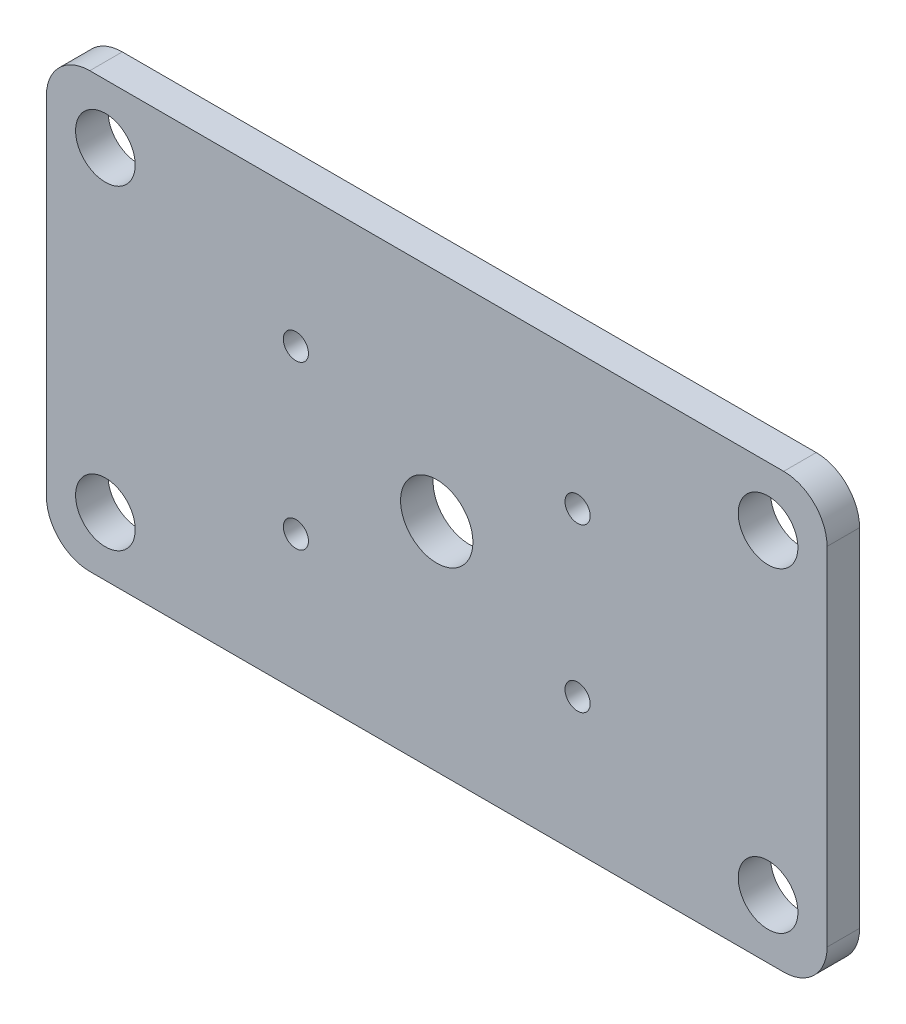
from build123d import *

# Parameters (mm, degrees)
SKETCH1_R           = 1.8415
SKETCH1_R_2         = 4.3688
SKETCH1_R_3         = 5.2959
BOSS_EXTRUDE1_DEPTH = 4.7625


with BuildPart() as part:
    # Sketch1 → Boss-Extrude1 (new body)
    with BuildSketch(Plane.XY.offset(4.7625)):
        with BuildLine():
            Line((57.15, -25.4), (57.15, 25.4))
            ThreePointArc((57.15, 25.4), (55.290128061, 29.890128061), (50.8, 31.75))
            Line((50.8, 31.75), (-50.8, 31.75))
            ThreePointArc((-50.8, 31.75), (-55.290128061, 29.890128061), (-57.15, 25.4))
            Line((-57.15, 25.4), (-57.15, -25.4))
            ThreePointArc((-57.15, -25.4), (-55.290128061, -29.890128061), (-50.8, -31.75))
            Line((-50.8, -31.75), (50.8, -31.75))
            ThreePointArc((50.8, -31.75), (55.290128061, -29.890128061), (57.15, -25.4))
        make_face()
        with Locations((-20.622229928, 11.90625)):
            Circle(SKETCH1_R, mode=Mode.SUBTRACT)
        with Locations((-20.622229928, -11.90625)):
            Circle(SKETCH1_R, mode=Mode.SUBTRACT)
        with Locations((20.622229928, -11.90625)):
            Circle(SKETCH1_R, mode=Mode.SUBTRACT)
        with Locations((20.622229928, 11.90625)):
            Circle(SKETCH1_R, mode=Mode.SUBTRACT)
        with Locations((48.514, -23.114)):
            Circle(SKETCH1_R_2, mode=Mode.SUBTRACT)
        with Locations((48.514, 23.114)):
            Circle(SKETCH1_R_2, mode=Mode.SUBTRACT)
        with Locations((-48.514, -23.114)):
            Circle(SKETCH1_R_2, mode=Mode.SUBTRACT)
        with Locations((-48.514, 23.114)):
            Circle(SKETCH1_R_2, mode=Mode.SUBTRACT)
        Circle(SKETCH1_R_3, mode=Mode.SUBTRACT)
    extrude(amount=-BOSS_EXTRUDE1_DEPTH)


solid = part.part
